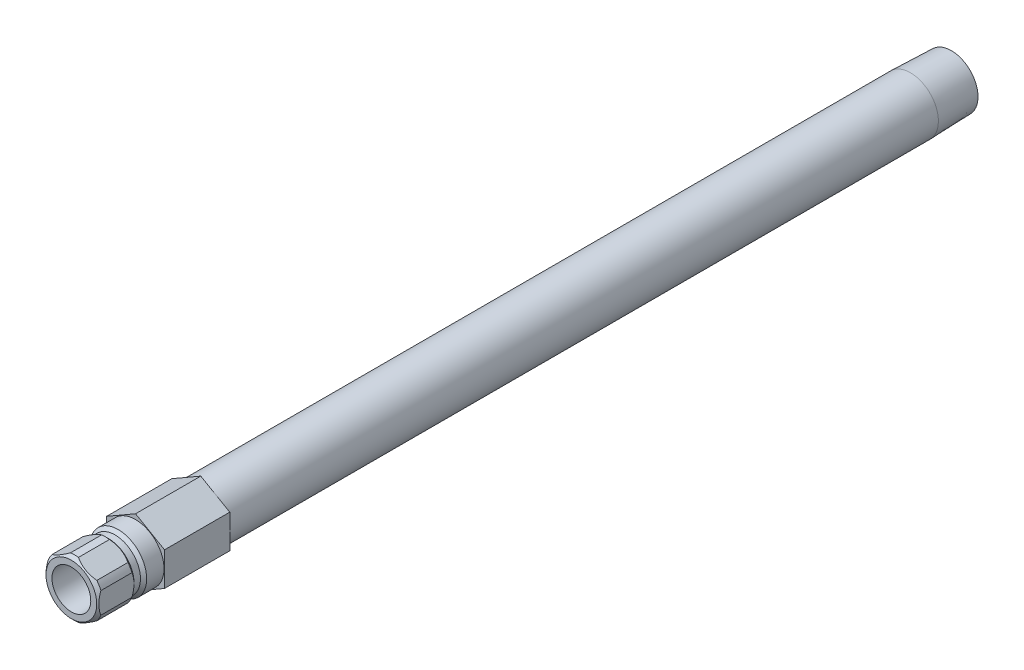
ISO-10303-21;
HEADER;
FILE_DESCRIPTION(('STEP AP214'),'2;1');
FILE_NAME('part.step','',(''),(''),'','','');
FILE_SCHEMA(('AUTOMOTIVE_DESIGN { 1 0 10303 214 1 1 1 1 }'));
ENDSEC;
DATA;
#1=APPLICATION_CONTEXT('core data for automotive mechanical design processes');
#2=APPLICATION_PROTOCOL_DEFINITION('international standard','automotive_design',2000,#1);
#3=PRODUCT_CONTEXT('',#1,'mechanical');
#4=PRODUCT('Part','Part','',(#3));
#5=PRODUCT_RELATED_PRODUCT_CATEGORY('part','',(#4));
#6=PRODUCT_DEFINITION_FORMATION('','',#4);
#7=PRODUCT_DEFINITION_CONTEXT('part definition',#1,'design');
#8=PRODUCT_DEFINITION('design','',#6,#7);
#9=PRODUCT_DEFINITION_SHAPE('','',#8);
#10=(LENGTH_UNIT() NAMED_UNIT(*) SI_UNIT(.MILLI.,.METRE.));
#11=(NAMED_UNIT(*) PLANE_ANGLE_UNIT() SI_UNIT($,.RADIAN.));
#12=(NAMED_UNIT(*) SI_UNIT($,.STERADIAN.) SOLID_ANGLE_UNIT());
#13=UNCERTAINTY_MEASURE_WITH_UNIT(LENGTH_MEASURE(1.E-05),#10,'distance_accuracy_value','');
#14=(GEOMETRIC_REPRESENTATION_CONTEXT(3) GLOBAL_UNCERTAINTY_ASSIGNED_CONTEXT((#13)) GLOBAL_UNIT_ASSIGNED_CONTEXT((#10,
#11,#12)) REPRESENTATION_CONTEXT('',''));
#15=CARTESIAN_POINT('',(0.,0.,0.));
#16=DIRECTION('',(0.,0.,1.));
#17=DIRECTION('',(1.,0.,0.));
#18=AXIS2_PLACEMENT_3D('',#15,#16,#17);
#19=CARTESIAN_POINT('',(0.,0.,12.8748331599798));
#20=DIRECTION('',(0.,0.,-1.));
#21=DIRECTION('',(0.,1.,0.));
#22=AXIS2_PLACEMENT_3D('',#19,#20,#21);
#23=CYLINDRICAL_SURFACE('',#22,6.985);
#24=DIRECTION('',(0.,0.,-1.));
#25=VECTOR('',#24,1.);
#26=CARTESIAN_POINT('',(5.50323442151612,-4.30170151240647,12.8748331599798));
#27=LINE('',#26,#25);
#28=CARTESIAN_POINT('',(5.50323442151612,-4.30170151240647,7.366));
#29=VERTEX_POINT('',#28);
#30=CARTESIAN_POINT('',(5.50323442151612,-4.30170151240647,14.986));
#31=VERTEX_POINT('',#30);
#32=EDGE_CURVE('E452',#29,#31,#27,.F.);
#33=ORIENTED_EDGE('',*,*,#32,.F.);
#34=CARTESIAN_POINT('',(0.,0.,7.366));
#35=DIRECTION('',(0.,0.,-1.));
#36=DIRECTION('',(0.,1.,0.));
#37=AXIS2_PLACEMENT_3D('',#34,#35,#36);
#38=CIRCLE('',#37,6.985);
#39=CARTESIAN_POINT('',(6.477,-2.6150900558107,7.366));
#40=VERTEX_POINT('',#39);
#41=EDGE_CURVE('E190',#40,#29,#38,.T.);
#42=ORIENTED_EDGE('',*,*,#41,.F.);
#43=DIRECTION('',(0.,0.,-1.));
#44=VECTOR('',#43,1.);
#45=CARTESIAN_POINT('',(6.477,-2.6150900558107,12.8748331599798));
#46=LINE('',#45,#44);
#47=CARTESIAN_POINT('',(6.477,-2.6150900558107,14.986));
#48=VERTEX_POINT('',#47);
#49=EDGE_CURVE('E367',#48,#40,#46,.T.);
#50=ORIENTED_EDGE('',*,*,#49,.F.);
#51=CARTESIAN_POINT('',(0.,0.,14.986));
#52=DIRECTION('',(0.,0.,-1.));
#53=DIRECTION('',(0.,1.,0.));
#54=AXIS2_PLACEMENT_3D('',#51,#52,#53);
#55=CIRCLE('',#54,6.985);
#56=EDGE_CURVE('E355',#48,#31,#55,.T.);
#57=ORIENTED_EDGE('',*,*,#56,.T.);
#58=EDGE_LOOP('',(#33,#42,#50,#57));
#59=FACE_BOUND('',#58,.T.);
#60=ADVANCED_FACE('F34',(#59),#23,.T.);
#61=DIRECTION('',(0.,0.,-1.));
#62=VECTOR('',#61,1.);
#63=CARTESIAN_POINT('',(6.477,2.6150900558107,12.8748331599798));
#64=LINE('',#63,#62);
#65=CARTESIAN_POINT('',(6.477,2.6150900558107,7.366));
#66=VERTEX_POINT('',#65);
#67=CARTESIAN_POINT('',(6.477,2.6150900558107,14.986));
#68=VERTEX_POINT('',#67);
#69=EDGE_CURVE('E279',#66,#68,#64,.F.);
#70=ORIENTED_EDGE('',*,*,#69,.F.);
#71=CARTESIAN_POINT('',(5.50323442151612,4.30170151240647,7.366));
#72=VERTEX_POINT('',#71);
#73=EDGE_CURVE('E193',#72,#66,#38,.T.);
#74=ORIENTED_EDGE('',*,*,#73,.F.);
#75=DIRECTION('',(0.,0.,-1.));
#76=VECTOR('',#75,1.);
#77=CARTESIAN_POINT('',(5.50323442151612,4.30170151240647,12.8748331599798));
#78=LINE('',#77,#76);
#79=CARTESIAN_POINT('',(5.50323442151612,4.30170151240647,14.986));
#80=VERTEX_POINT('',#79);
#81=EDGE_CURVE('E351',#80,#72,#78,.T.);
#82=ORIENTED_EDGE('',*,*,#81,.F.);
#83=EDGE_CURVE('E205',#80,#68,#55,.T.);
#84=ORIENTED_EDGE('',*,*,#83,.T.);
#85=EDGE_LOOP('',(#70,#74,#82,#84));
#86=FACE_BOUND('',#85,.T.);
#87=ADVANCED_FACE('F313',(#86),#23,.T.);
#88=DIRECTION('',(0.,0.,-1.));
#89=VECTOR('',#88,1.);
#90=CARTESIAN_POINT('',(0.973765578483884,6.91679156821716,12.8748331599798));
#91=LINE('',#90,#89);
#92=CARTESIAN_POINT('',(0.973765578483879,6.91679156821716,7.366));
#93=VERTEX_POINT('',#92);
#94=CARTESIAN_POINT('',(0.973765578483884,6.91679156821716,14.986));
#95=VERTEX_POINT('',#94);
#96=EDGE_CURVE('E370',#93,#95,#91,.F.);
#97=ORIENTED_EDGE('',*,*,#96,.F.);
#98=CARTESIAN_POINT('',(-0.97376557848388,6.91679156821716,7.366));
#99=VERTEX_POINT('',#98);
#100=EDGE_CURVE('E195',#99,#93,#38,.T.);
#101=ORIENTED_EDGE('',*,*,#100,.F.);
#102=DIRECTION('',(0.,0.,-1.));
#103=VECTOR('',#102,1.);
#104=CARTESIAN_POINT('',(-0.973765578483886,6.91679156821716,12.8748331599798));
#105=LINE('',#104,#103);
#106=CARTESIAN_POINT('',(-0.973765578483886,6.91679156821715,14.986));
#107=VERTEX_POINT('',#106);
#108=EDGE_CURVE('E54',#107,#99,#105,.T.);
#109=ORIENTED_EDGE('',*,*,#108,.F.);
#110=EDGE_CURVE('E201',#107,#95,#55,.T.);
#111=ORIENTED_EDGE('',*,*,#110,.T.);
#112=EDGE_LOOP('',(#97,#101,#109,#111));
#113=FACE_BOUND('',#112,.T.);
#114=ADVANCED_FACE('F318',(#113),#23,.T.);
#115=DIRECTION('',(0.,0.,-1.));
#116=VECTOR('',#115,1.);
#117=CARTESIAN_POINT('',(-5.50323442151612,4.30170151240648,12.8748331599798));
#118=LINE('',#117,#116);
#119=CARTESIAN_POINT('',(-5.50323442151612,4.30170151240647,7.366));
#120=VERTEX_POINT('',#119);
#121=CARTESIAN_POINT('',(-5.50323442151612,4.30170151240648,14.986));
#122=VERTEX_POINT('',#121);
#123=EDGE_CURVE('E349',#120,#122,#118,.F.);
#124=ORIENTED_EDGE('',*,*,#123,.F.);
#125=CARTESIAN_POINT('',(-6.477,2.61509005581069,7.366));
#126=VERTEX_POINT('',#125);
#127=EDGE_CURVE('E194',#126,#120,#38,.T.);
#128=ORIENTED_EDGE('',*,*,#127,.F.);
#129=DIRECTION('',(0.,0.,-1.));
#130=VECTOR('',#129,1.);
#131=CARTESIAN_POINT('',(-6.477,2.61509005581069,12.8748331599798));
#132=LINE('',#131,#130);
#133=CARTESIAN_POINT('',(-6.477,2.61509005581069,14.986));
#134=VERTEX_POINT('',#133);
#135=EDGE_CURVE('E62',#134,#126,#132,.T.);
#136=ORIENTED_EDGE('',*,*,#135,.F.);
#137=EDGE_CURVE('E204',#134,#122,#55,.T.);
#138=ORIENTED_EDGE('',*,*,#137,.T.);
#139=EDGE_LOOP('',(#124,#128,#136,#138));
#140=FACE_BOUND('',#139,.T.);
#141=ADVANCED_FACE('F329',(#140),#23,.T.);
#142=DIRECTION('',(0.,0.,-1.));
#143=VECTOR('',#142,1.);
#144=CARTESIAN_POINT('',(-6.477,-2.61509005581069,12.8748331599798));
#145=LINE('',#144,#143);
#146=CARTESIAN_POINT('',(-6.477,-2.61509005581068,7.366));
#147=VERTEX_POINT('',#146);
#148=CARTESIAN_POINT('',(-6.477,-2.61509005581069,14.986));
#149=VERTEX_POINT('',#148);
#150=EDGE_CURVE('E340',#147,#149,#145,.F.);
#151=ORIENTED_EDGE('',*,*,#150,.F.);
#152=CARTESIAN_POINT('',(-5.50323442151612,-4.30170151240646,7.366));
#153=VERTEX_POINT('',#152);
#154=EDGE_CURVE('E191',#153,#147,#38,.T.);
#155=ORIENTED_EDGE('',*,*,#154,.F.);
#156=DIRECTION('',(0.,0.,-1.));
#157=VECTOR('',#156,1.);
#158=CARTESIAN_POINT('',(-5.50323442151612,-4.30170151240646,12.8748331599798));
#159=LINE('',#158,#157);
#160=CARTESIAN_POINT('',(-5.50323442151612,-4.30170151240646,14.986));
#161=VERTEX_POINT('',#160);
#162=EDGE_CURVE('E168',#161,#153,#159,.T.);
#163=ORIENTED_EDGE('',*,*,#162,.F.);
#164=EDGE_CURVE('E342',#161,#149,#55,.T.);
#165=ORIENTED_EDGE('',*,*,#164,.T.);
#166=EDGE_LOOP('',(#151,#155,#163,#165));
#167=FACE_BOUND('',#166,.T.);
#168=ADVANCED_FACE('F322',(#167),#23,.T.);
#169=CARTESIAN_POINT('',(0.,0.,12.8748331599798));
#170=DIRECTION('',(0.,0.,-1.));
#171=DIRECTION('',(0.,1.,0.));
#172=AXIS2_PLACEMENT_3D('',#169,#170,#171);
#173=CYLINDRICAL_SURFACE('',#172,6.85799999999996);
#174=CARTESIAN_POINT('',(0.,0.,-190.119));
#175=DIRECTION('',(0.,0.,-1.));
#176=DIRECTION('',(0.,1.,0.));
#177=AXIS2_PLACEMENT_3D('',#174,#175,#176);
#178=CIRCLE('',#177,6.85799999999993);
#179=CARTESIAN_POINT('',(0.,6.858,-190.119));
#180=VERTEX_POINT('',#179);
#181=EDGE_CURVE('E520',#180,#180,#178,.T.);
#182=ORIENTED_EDGE('',*,*,#181,.F.);
#183=EDGE_LOOP('',(#182));
#184=FACE_BOUND('',#183,.T.);
#185=CARTESIAN_POINT('',(0.,0.,-16.002));
#186=DIRECTION('',(0.,0.,1.));
#187=DIRECTION('',(1.,0.,0.));
#188=AXIS2_PLACEMENT_3D('',#185,#186,#187);
#189=CIRCLE('',#188,6.85799999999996);
#190=CARTESIAN_POINT('',(6.85799999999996,0.,-16.002));
#191=VERTEX_POINT('',#190);
#192=EDGE_CURVE('E496',#191,#191,#189,.F.);
#193=ORIENTED_EDGE('',*,*,#192,.T.);
#194=EDGE_LOOP('',(#193));
#195=FACE_BOUND('',#194,.T.);
#196=ADVANCED_FACE('F328',(#184,#195),#173,.T.);
#197=CARTESIAN_POINT('',(0.,0.,12.8748331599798));
#198=DIRECTION('',(0.,0.,-1.));
#199=DIRECTION('',(0.,1.,0.));
#200=AXIS2_PLACEMENT_3D('',#197,#198,#199);
#201=CYLINDRICAL_SURFACE('',#200,4.7625);
#202=CARTESIAN_POINT('',(0.,0.,3.556));
#203=DIRECTION('',(0.,0.,-1.));
#204=DIRECTION('',(0.,1.,0.));
#205=AXIS2_PLACEMENT_3D('',#202,#203,#204);
#206=CIRCLE('',#205,4.76249999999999);
#207=CARTESIAN_POINT('',(0.,4.7625,3.556));
#208=VERTEX_POINT('',#207);
#209=EDGE_CURVE('E508',#208,#208,#206,.T.);
#210=ORIENTED_EDGE('',*,*,#209,.T.);
#211=EDGE_LOOP('',(#210));
#212=FACE_BOUND('',#211,.T.);
#213=CARTESIAN_POINT('',(0.,0.,15.748));
#214=DIRECTION('',(0.,0.,-1.));
#215=DIRECTION('',(0.,1.,0.));
#216=AXIS2_PLACEMENT_3D('',#213,#214,#215);
#217=CIRCLE('',#216,4.7625);
#218=CARTESIAN_POINT('',(0.,4.7625,15.748));
#219=VERTEX_POINT('',#218);
#220=EDGE_CURVE('E174',#219,#219,#217,.T.);
#221=ORIENTED_EDGE('',*,*,#220,.F.);
#222=EDGE_LOOP('',(#221));
#223=FACE_BOUND('',#222,.T.);
#224=ADVANCED_FACE('F36',(#212,#223),#201,.F.);
#225=CARTESIAN_POINT('',(0.,4.7625,15.748));
#226=DIRECTION('',(0.,0.,1.));
#227=DIRECTION('',(0.,-1.,0.));
#228=AXIS2_PLACEMENT_3D('',#225,#226,#227);
#229=PLANE('',#228);
#230=ORIENTED_EDGE('',*,*,#220,.T.);
#231=EDGE_LOOP('',(#230));
#232=FACE_BOUND('',#231,.T.);
#233=CARTESIAN_POINT('',(0.,0.,15.748));
#234=DIRECTION('',(0.,0.,-1.));
#235=DIRECTION('',(0.,1.,0.));
#236=AXIS2_PLACEMENT_3D('',#233,#234,#235);
#237=CIRCLE('',#236,6.223);
#238=CARTESIAN_POINT('',(0.,6.223,15.748));
#239=VERTEX_POINT('',#238);
#240=EDGE_CURVE('E206',#239,#239,#237,.T.);
#241=ORIENTED_EDGE('',*,*,#240,.F.);
#242=EDGE_LOOP('',(#241));
#243=FACE_BOUND('',#242,.T.);
#244=ADVANCED_FACE('F241',(#232,#243),#229,.T.);
#245=CARTESIAN_POINT('',(0.,0.,14.986));
#246=DIRECTION('',(0.,0.,-1.));
#247=DIRECTION('',(0.,1.,0.));
#248=AXIS2_PLACEMENT_3D('',#245,#246,#247);
#249=CONICAL_SURFACE('',#248,6.985,0.785398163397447);
#250=CARTESIAN_POINT('',(5.50369701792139,-4.30143443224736,14.9858));
#251=CARTESIAN_POINT('',(5.32269478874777,-4.40593611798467,15.0641166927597));
#252=CARTESIAN_POINT('',(5.13917907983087,-4.51188896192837,15.1353544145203));
#253=CARTESIAN_POINT('',(4.76736839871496,-4.72655395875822,15.2608524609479));
#254=CARTESIAN_POINT('',(4.57906245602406,-4.83527244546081,15.3150691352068));
#255=CARTESIAN_POINT('',(4.20553846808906,-5.05092662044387,15.401724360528));
#256=CARTESIAN_POINT('',(4.02044501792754,-5.15779037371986,15.4348622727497));
#257=CARTESIAN_POINT('',(3.64855359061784,-5.37250198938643,15.4802195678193));
#258=CARTESIAN_POINT('',(3.46175806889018,-5.48034843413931,15.4924653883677));
#259=CARTESIAN_POINT('',(3.08219421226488,-5.69948972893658,15.4953056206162));
#260=CARTESIAN_POINT('',(2.88942157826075,-5.81078706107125,15.4852117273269));
#261=CARTESIAN_POINT('',(2.50551871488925,-6.03243348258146,15.4426708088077));
#262=CARTESIAN_POINT('',(2.31439108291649,-6.14278107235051,15.4101933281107));
#263=CARTESIAN_POINT('',(1.92845877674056,-6.36559919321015,15.3234273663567));
#264=CARTESIAN_POINT('',(1.73378601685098,-6.47799356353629,15.268364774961));
#265=CARTESIAN_POINT('',(1.44558978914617,-6.6443837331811,15.1720079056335));
#266=CARTESIAN_POINT('',(1.35026676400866,-6.69941850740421,15.1376422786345));
#267=CARTESIAN_POINT('',(1.16086120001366,-6.80877186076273,15.0647445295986));
#268=CARTESIAN_POINT('',(1.06677820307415,-6.86309070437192,15.0262139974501));
#269=CARTESIAN_POINT('',(0.973302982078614,-6.91705864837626,14.9858));
#270=B_SPLINE_CURVE_WITH_KNOTS('',3,(#250,#251,#252,#253,#254,#255,#256,#257,#258,#259,#260,
#261,#262,#263,#264,#265,#266,#267,#268,#269),.UNSPECIFIED.,.F.,.F.,(4,2,2,2,2,2,2,2,2,4),(0.,
0.669810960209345,1.34132587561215,1.9892054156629,2.63626449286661,3.30353665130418,
3.97171850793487,4.66502165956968,5.01088265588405,5.35661208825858),.UNSPECIFIED.);
#271=CARTESIAN_POINT('',(0.973765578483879,-6.91679156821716,14.986));
#272=VERTEX_POINT('',#271);
#273=EDGE_CURVE('E451',#31,#272,#270,.T.);
#274=ORIENTED_EDGE('',*,*,#273,.F.);
#275=ORIENTED_EDGE('',*,*,#56,.F.);
#276=CARTESIAN_POINT('',(6.477,-7.50531717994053,12.0573066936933));
#277=CARTESIAN_POINT('',(6.477,-7.32278230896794,12.1954662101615));
#278=CARTESIAN_POINT('',(6.477,-7.13923073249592,12.3323042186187));
#279=CARTESIAN_POINT('',(6.477,-6.76969107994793,12.6027438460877));
#280=CARTESIAN_POINT('',(6.477,-6.58370240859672,12.7363446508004));
#281=CARTESIAN_POINT('',(6.477,-6.20752484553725,13.0006667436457));
#282=CARTESIAN_POINT('',(6.477,-6.01731457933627,13.1313577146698));
#283=CARTESIAN_POINT('',(6.477,-5.63367369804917,13.3879087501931));
#284=CARTESIAN_POINT('',(6.477,-5.44024331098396,13.5137691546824));
#285=CARTESIAN_POINT('',(6.477,-5.03831720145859,13.7667102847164));
#286=CARTESIAN_POINT('',(6.477,-4.8295984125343,13.893438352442));
#287=CARTESIAN_POINT('',(6.477,-4.4072839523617,14.1386241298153));
#288=CARTESIAN_POINT('',(6.477,-4.19368750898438,14.2570805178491));
#289=CARTESIAN_POINT('',(6.477,-3.7616267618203,14.4831715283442));
#290=CARTESIAN_POINT('',(6.477,-3.54317924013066,14.5908379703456));
#291=CARTESIAN_POINT('',(6.477,-3.100295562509,14.7929384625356));
#292=CARTESIAN_POINT('',(6.477,-2.87586219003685,14.8873785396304));
#293=CARTESIAN_POINT('',(6.477,-2.43955826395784,15.0524966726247));
#294=CARTESIAN_POINT('',(6.477,-2.22819339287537,15.1244971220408));
#295=CARTESIAN_POINT('',(6.477,-1.80033354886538,15.2515475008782));
#296=CARTESIAN_POINT('',(6.477,-1.58383822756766,15.3065962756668));
#297=CARTESIAN_POINT('',(6.477,-1.15063390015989,15.3959385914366));
#298=CARTESIAN_POINT('',(6.477,-0.934000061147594,15.4305906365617));
#299=CARTESIAN_POINT('',(6.477,-0.498364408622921,15.4784594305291));
#300=CARTESIAN_POINT('',(6.477,-0.279363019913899,15.4916799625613));
#301=CARTESIAN_POINT('',(6.477,0.150697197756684,15.4956835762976));
#302=CARTESIAN_POINT('',(6.477,0.361748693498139,15.4872823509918));
#303=CARTESIAN_POINT('',(6.477,0.782066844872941,15.4503172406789));
#304=CARTESIAN_POINT('',(6.477,0.991333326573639,15.421751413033));
#305=CARTESIAN_POINT('',(6.477,1.41010575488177,15.3455375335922));
#306=CARTESIAN_POINT('',(6.477,1.6195513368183,15.2975631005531));
#307=CARTESIAN_POINT('',(6.477,2.03387291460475,15.1851046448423));
#308=CARTESIAN_POINT('',(6.477,2.2387492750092,15.1206219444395));
#309=CARTESIAN_POINT('',(6.477,2.66141718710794,14.9715598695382));
#310=CARTESIAN_POINT('',(6.477,2.87875617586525,14.8857103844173));
#311=CARTESIAN_POINT('',(6.477,3.30779766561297,14.7008180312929));
#312=CARTESIAN_POINT('',(6.477,3.51949749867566,14.6017690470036));
#313=CARTESIAN_POINT('',(6.477,3.9382898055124,14.3928329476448));
#314=CARTESIAN_POINT('',(6.477,4.14536521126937,14.282911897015));
#315=CARTESIAN_POINT('',(6.477,4.55475391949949,14.0546596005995));
#316=CARTESIAN_POINT('',(6.477,4.75706796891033,13.93632968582));
#317=CARTESIAN_POINT('',(6.477,5.14761370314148,13.6989609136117));
#318=CARTESIAN_POINT('',(6.477,5.33604552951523,13.580249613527));
#319=CARTESIAN_POINT('',(6.477,5.70967381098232,13.3378251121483));
#320=CARTESIAN_POINT('',(6.477,5.89487001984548,13.2141115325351));
#321=CARTESIAN_POINT('',(6.477,6.26095063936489,12.9635958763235));
#322=CARTESIAN_POINT('',(6.477,6.44185783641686,12.8368269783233));
#323=CARTESIAN_POINT('',(6.477,6.80119835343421,12.5799293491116));
#324=CARTESIAN_POINT('',(6.477,6.97963234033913,12.4498015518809));
#325=CARTESIAN_POINT('',(6.477,7.15703038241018,12.3183002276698));
#326=B_SPLINE_CURVE_WITH_KNOTS('',3,(#276,#277,#278,#279,#280,#281,#282,#283,#284,#285,#286,
#287,#288,#289,#290,#291,#292,#293,#294,#295,#296,#297,#298,#299,#300,#301,#302,#303,#304,#305,
#306,#307,#308,#309,#310,#311,#312,#313,#314,#315,#316,#317,#318,#319,#320,#321,#322,#323,#324,
#325),.UNSPECIFIED.,.F.,.F.,(4,2,2,2,2,2,2,2,2,2,2,2,2,2,2,2,2,2,2,2,2,2,2,2,4),(0.,
0.686790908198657,1.37375281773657,2.06603541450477,2.75826919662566,3.49065471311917,
4.22315698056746,4.95343127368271,5.68337170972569,6.35265989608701,7.02199365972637,
7.67918147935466,8.33625327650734,8.96890298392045,9.6016136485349,10.2454384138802,
10.8892116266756,11.5897073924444,12.2905288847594,12.9936114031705,13.6965828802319,
14.3646145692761,15.0326968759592,15.6953618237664,16.3578444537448),.UNSPECIFIED.);
#327=EDGE_CURVE('E271',#68,#48,#326,.F.);
#328=ORIENTED_EDGE('',*,*,#327,.F.);
#329=ORIENTED_EDGE('',*,*,#83,.F.);
#330=CARTESIAN_POINT('',(0.973302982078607,6.91705864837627,14.9858));
#331=CARTESIAN_POINT('',(1.15430521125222,6.81255696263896,15.0641166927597));
#332=CARTESIAN_POINT('',(1.33782092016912,6.70660411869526,15.1353544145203));
#333=CARTESIAN_POINT('',(1.70963160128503,6.49193912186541,15.2608524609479));
#334=CARTESIAN_POINT('',(1.89793754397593,6.38322063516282,15.3150691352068));
#335=CARTESIAN_POINT('',(2.27146153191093,6.16756646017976,15.401724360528));
#336=CARTESIAN_POINT('',(2.45655498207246,6.06070270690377,15.4348622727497));
#337=CARTESIAN_POINT('',(2.82844640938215,5.8459910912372,15.4802195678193));
#338=CARTESIAN_POINT('',(3.01524193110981,5.73814464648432,15.4924653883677));
#339=CARTESIAN_POINT('',(3.39480578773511,5.51900335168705,15.4953056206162));
#340=CARTESIAN_POINT('',(3.58757842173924,5.40770601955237,15.4852117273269));
#341=CARTESIAN_POINT('',(3.97148128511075,5.18605959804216,15.4426708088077));
#342=CARTESIAN_POINT('',(4.16260891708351,5.07571200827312,15.4101933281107));
#343=CARTESIAN_POINT('',(4.54854122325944,4.85289388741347,15.3234273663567));
#344=CARTESIAN_POINT('',(4.74321398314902,4.74049951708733,15.268364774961));
#345=CARTESIAN_POINT('',(5.03141021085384,4.57410934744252,15.1720079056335));
#346=CARTESIAN_POINT('',(5.12673323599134,4.51907457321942,15.1376422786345));
#347=CARTESIAN_POINT('',(5.31613879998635,4.40972121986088,15.0647445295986));
#348=CARTESIAN_POINT('',(5.41022179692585,4.3554023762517,15.0262139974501));
#349=CARTESIAN_POINT('',(5.50369701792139,4.30143443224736,14.9858));
#350=B_SPLINE_CURVE_WITH_KNOTS('',3,(#330,#331,#332,#333,#334,#335,#336,#337,#338,#339,#340,
#341,#342,#343,#344,#345,#346,#347,#348,#349),.UNSPECIFIED.,.F.,.F.,(4,2,2,2,2,2,2,2,2,4),(0.,
0.669810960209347,1.34132587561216,1.9892054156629,2.63626449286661,3.30353665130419,
3.97171850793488,4.66502165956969,5.01088265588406,5.35661208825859),.UNSPECIFIED.);
#351=EDGE_CURVE('E263',#95,#80,#350,.T.);
#352=ORIENTED_EDGE('',*,*,#351,.F.);
#353=ORIENTED_EDGE('',*,*,#110,.F.);
#354=CARTESIAN_POINT('',(-5.50369701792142,4.30143443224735,14.9858));
#355=CARTESIAN_POINT('',(-5.3226947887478,4.40593611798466,15.0641166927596));
#356=CARTESIAN_POINT('',(-5.1391790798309,4.51188896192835,15.1353544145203));
#357=CARTESIAN_POINT('',(-4.76736839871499,4.72655395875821,15.2608524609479));
#358=CARTESIAN_POINT('',(-4.57906245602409,4.8352724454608,15.3150691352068));
#359=CARTESIAN_POINT('',(-4.20553846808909,5.05092662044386,15.401724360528));
#360=CARTESIAN_POINT('',(-4.02044501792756,5.15779037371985,15.4348622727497));
#361=CARTESIAN_POINT('',(-3.64855359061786,5.37250198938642,15.4802195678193));
#362=CARTESIAN_POINT('',(-3.4617580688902,5.4803484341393,15.4924653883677));
#363=CARTESIAN_POINT('',(-3.0821942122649,5.69948972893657,15.4953056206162));
#364=CARTESIAN_POINT('',(-2.88942157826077,5.81078706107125,15.4852117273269));
#365=CARTESIAN_POINT('',(-2.50551871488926,6.03243348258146,15.4426708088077));
#366=CARTESIAN_POINT('',(-2.3143910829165,6.14278107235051,15.4101933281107));
#367=CARTESIAN_POINT('',(-1.92845877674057,6.36559919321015,15.3234273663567));
#368=CARTESIAN_POINT('',(-1.73378601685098,6.47799356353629,15.268364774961));
#369=CARTESIAN_POINT('',(-1.44558978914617,6.6443837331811,15.1720079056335));
#370=CARTESIAN_POINT('',(-1.35026676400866,6.69941850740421,15.1376422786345));
#371=CARTESIAN_POINT('',(-1.16086120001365,6.80877186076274,15.0647445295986));
#372=CARTESIAN_POINT('',(-1.06677820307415,6.86309070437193,15.0262139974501));
#373=CARTESIAN_POINT('',(-0.97330298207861,6.91705864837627,14.9858));
#374=B_SPLINE_CURVE_WITH_KNOTS('',3,(#354,#355,#356,#357,#358,#359,#360,#361,#362,#363,#364,
#365,#366,#367,#368,#369,#370,#371,#372,#373),.UNSPECIFIED.,.F.,.F.,(4,2,2,2,2,2,2,2,2,4),(0.,
0.66981096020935,1.34132587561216,1.98920541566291,2.63626449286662,3.3035366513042,
3.9717185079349,4.66502165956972,5.01088265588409,5.35661208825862),.UNSPECIFIED.);
#375=EDGE_CURVE('E256',#122,#107,#374,.T.);
#376=ORIENTED_EDGE('',*,*,#375,.F.);
#377=ORIENTED_EDGE('',*,*,#137,.F.);
#378=CARTESIAN_POINT('',(-6.477,-7.50531717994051,12.0573066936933));
#379=CARTESIAN_POINT('',(-6.477,-7.32278230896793,12.1954662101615));
#380=CARTESIAN_POINT('',(-6.477,-7.13923073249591,12.3323042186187));
#381=CARTESIAN_POINT('',(-6.477,-6.76969107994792,12.6027438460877));
#382=CARTESIAN_POINT('',(-6.477,-6.58370240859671,12.7363446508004));
#383=CARTESIAN_POINT('',(-6.477,-6.20752484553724,13.0006667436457));
#384=CARTESIAN_POINT('',(-6.477,-6.01731457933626,13.1313577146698));
#385=CARTESIAN_POINT('',(-6.477,-5.63367369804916,13.3879087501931));
#386=CARTESIAN_POINT('',(-6.477,-5.44024331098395,13.5137691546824));
#387=CARTESIAN_POINT('',(-6.477,-5.03831720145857,13.7667102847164));
#388=CARTESIAN_POINT('',(-6.477,-4.82959841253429,13.8934383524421));
#389=CARTESIAN_POINT('',(-6.477,-4.40728395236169,14.1386241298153));
#390=CARTESIAN_POINT('',(-6.477,-4.19368750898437,14.2570805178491));
#391=CARTESIAN_POINT('',(-6.477,-3.76162676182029,14.4831715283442));
#392=CARTESIAN_POINT('',(-6.477,-3.54317924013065,14.5908379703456));
#393=CARTESIAN_POINT('',(-6.477,-3.10029556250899,14.7929384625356));
#394=CARTESIAN_POINT('',(-6.477,-2.87586219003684,14.8873785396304));
#395=CARTESIAN_POINT('',(-6.477,-2.43955826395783,15.0524966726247));
#396=CARTESIAN_POINT('',(-6.477,-2.22819339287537,15.1244971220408));
#397=CARTESIAN_POINT('',(-6.477,-1.80033354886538,15.2515475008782));
#398=CARTESIAN_POINT('',(-6.477,-1.58383822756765,15.3065962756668));
#399=CARTESIAN_POINT('',(-6.477,-1.15063390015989,15.3959385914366));
#400=CARTESIAN_POINT('',(-6.477,-0.934000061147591,15.4305906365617));
#401=CARTESIAN_POINT('',(-6.477,-0.49836440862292,15.4784594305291));
#402=CARTESIAN_POINT('',(-6.477,-0.279363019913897,15.4916799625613));
#403=CARTESIAN_POINT('',(-6.477,0.150697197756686,15.4956835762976));
#404=CARTESIAN_POINT('',(-6.477,0.361748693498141,15.4872823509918));
#405=CARTESIAN_POINT('',(-6.477,0.782066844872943,15.4503172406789));
#406=CARTESIAN_POINT('',(-6.477,0.991333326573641,15.421751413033));
#407=CARTESIAN_POINT('',(-6.477,1.41010575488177,15.3455375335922));
#408=CARTESIAN_POINT('',(-6.477,1.6195513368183,15.2975631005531));
#409=CARTESIAN_POINT('',(-6.477,2.03387291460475,15.1851046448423));
#410=CARTESIAN_POINT('',(-6.477,2.2387492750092,15.1206219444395));
#411=CARTESIAN_POINT('',(-6.477,2.66141718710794,14.9715598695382));
#412=CARTESIAN_POINT('',(-6.477,2.87875617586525,14.8857103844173));
#413=CARTESIAN_POINT('',(-6.477,3.30779766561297,14.7008180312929));
#414=CARTESIAN_POINT('',(-6.477,3.51949749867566,14.6017690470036));
#415=CARTESIAN_POINT('',(-6.477,3.93828980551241,14.3928329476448));
#416=CARTESIAN_POINT('',(-6.477,4.14536521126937,14.282911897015));
#417=CARTESIAN_POINT('',(-6.477,4.55475391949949,14.0546596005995));
#418=CARTESIAN_POINT('',(-6.477,4.75706796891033,13.93632968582));
#419=CARTESIAN_POINT('',(-6.477,5.14761370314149,13.6989609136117));
#420=CARTESIAN_POINT('',(-6.477,5.33604552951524,13.580249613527));
#421=CARTESIAN_POINT('',(-6.477,5.70967381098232,13.3378251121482));
#422=CARTESIAN_POINT('',(-6.477,5.89487001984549,13.2141115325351));
#423=CARTESIAN_POINT('',(-6.477,6.2609506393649,12.9635958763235));
#424=CARTESIAN_POINT('',(-6.477,6.44185783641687,12.8368269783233));
#425=CARTESIAN_POINT('',(-6.477,6.80119835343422,12.5799293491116));
#426=CARTESIAN_POINT('',(-6.477,6.97963234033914,12.4498015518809));
#427=CARTESIAN_POINT('',(-6.477,7.15703038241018,12.3183002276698));
#428=B_SPLINE_CURVE_WITH_KNOTS('',3,(#378,#379,#380,#381,#382,#383,#384,#385,#386,#387,#388,
#389,#390,#391,#392,#393,#394,#395,#396,#397,#398,#399,#400,#401,#402,#403,#404,#405,#406,#407,
#408,#409,#410,#411,#412,#413,#414,#415,#416,#417,#418,#419,#420,#421,#422,#423,#424,#425,#426,
#427),.UNSPECIFIED.,.F.,.F.,(4,2,2,2,2,2,2,2,2,2,2,2,2,2,2,2,2,2,2,2,2,2,2,2,4),(0.,
0.686790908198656,1.37375281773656,2.06603541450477,2.75826919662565,3.49065471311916,
4.22315698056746,4.9534312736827,5.68337170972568,6.352659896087,7.02199365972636,
7.67918147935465,8.33625327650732,8.96890298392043,9.60161364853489,10.2454384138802,
10.8892116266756,11.5897073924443,12.2905288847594,12.9936114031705,13.6965828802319,
14.3646145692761,15.0326968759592,15.6953618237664,16.3578444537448),.UNSPECIFIED.);
#429=EDGE_CURVE('E249',#149,#134,#428,.T.);
#430=ORIENTED_EDGE('',*,*,#429,.F.);
#431=ORIENTED_EDGE('',*,*,#164,.F.);
#432=CARTESIAN_POINT('',(-0.973302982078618,-6.91705864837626,14.9858));
#433=CARTESIAN_POINT('',(-1.15430521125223,-6.81255696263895,15.0641166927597));
#434=CARTESIAN_POINT('',(-1.33782092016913,-6.70660411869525,15.1353544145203));
#435=CARTESIAN_POINT('',(-1.70963160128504,-6.49193912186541,15.2608524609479));
#436=CARTESIAN_POINT('',(-1.89793754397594,-6.38322063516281,15.3150691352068));
#437=CARTESIAN_POINT('',(-2.27146153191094,-6.16756646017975,15.401724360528));
#438=CARTESIAN_POINT('',(-2.45655498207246,-6.06070270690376,15.4348622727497));
#439=CARTESIAN_POINT('',(-2.82844640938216,-5.84599109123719,15.4802195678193));
#440=CARTESIAN_POINT('',(-3.01524193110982,-5.73814464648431,15.4924653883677));
#441=CARTESIAN_POINT('',(-3.39480578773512,-5.51900335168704,15.4953056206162));
#442=CARTESIAN_POINT('',(-3.58757842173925,-5.40770601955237,15.4852117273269));
#443=CARTESIAN_POINT('',(-3.97148128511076,-5.18605959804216,15.4426708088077));
#444=CARTESIAN_POINT('',(-4.16260891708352,-5.07571200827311,15.4101933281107));
#445=CARTESIAN_POINT('',(-4.54854122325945,-4.85289388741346,15.3234273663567));
#446=CARTESIAN_POINT('',(-4.74321398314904,-4.74049951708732,15.268364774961));
#447=CARTESIAN_POINT('',(-5.03141021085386,-4.57410934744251,15.1720079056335));
#448=CARTESIAN_POINT('',(-5.12673323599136,-4.5190745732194,15.1376422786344));
#449=CARTESIAN_POINT('',(-5.31613879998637,-4.40972121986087,15.0647445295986));
#450=CARTESIAN_POINT('',(-5.41022179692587,-4.35540237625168,15.0262139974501));
#451=CARTESIAN_POINT('',(-5.50369701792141,-4.30143443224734,14.9858));
#452=B_SPLINE_CURVE_WITH_KNOTS('',3,(#432,#433,#434,#435,#436,#437,#438,#439,#440,#441,#442,
#443,#444,#445,#446,#447,#448,#449,#450,#451),.UNSPECIFIED.,.F.,.F.,(4,2,2,2,2,2,2,2,2,4),(0.,
0.669810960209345,1.34132587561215,1.9892054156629,2.6362644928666,3.30353665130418,
3.97171850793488,4.6650216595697,5.01088265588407,5.35661208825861),.UNSPECIFIED.);
#453=CARTESIAN_POINT('',(-0.973765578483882,-6.91679156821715,14.986));
#454=VERTEX_POINT('',#453);
#455=EDGE_CURVE('E184',#454,#161,#452,.T.);
#456=ORIENTED_EDGE('',*,*,#455,.F.);
#457=EDGE_CURVE('E183',#272,#454,#55,.T.);
#458=ORIENTED_EDGE('',*,*,#457,.F.);
#459=EDGE_LOOP('',(#274,#275,#328,#329,#352,#353,#376,#377,#430,#431,#456,#458));
#460=FACE_BOUND('',#459,.T.);
#461=ORIENTED_EDGE('',*,*,#240,.T.);
#462=EDGE_LOOP('',(#461));
#463=FACE_BOUND('',#462,.T.);
#464=ADVANCED_FACE('F238',(#460,#463),#249,.T.);
#465=DIRECTION('',(0.,0.,-1.));
#466=VECTOR('',#465,1.);
#467=CARTESIAN_POINT('',(0.973765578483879,-6.91679156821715,12.8748331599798));
#468=LINE('',#467,#466);
#469=CARTESIAN_POINT('',(0.973765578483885,-6.91679156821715,7.366));
#470=VERTEX_POINT('',#469);
#471=EDGE_CURVE('E278',#272,#470,#468,.T.);
#472=ORIENTED_EDGE('',*,*,#471,.F.);
#473=ORIENTED_EDGE('',*,*,#457,.T.);
#474=DIRECTION('',(0.,0.,-1.));
#475=VECTOR('',#474,1.);
#476=CARTESIAN_POINT('',(-0.973765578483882,-6.91679156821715,12.8748331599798));
#477=LINE('',#476,#475);
#478=CARTESIAN_POINT('',(-0.973765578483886,-6.91679156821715,7.366));
#479=VERTEX_POINT('',#478);
#480=EDGE_CURVE('E165',#479,#454,#477,.F.);
#481=ORIENTED_EDGE('',*,*,#480,.F.);
#482=EDGE_CURVE('E181',#470,#479,#38,.T.);
#483=ORIENTED_EDGE('',*,*,#482,.F.);
#484=EDGE_LOOP('',(#472,#473,#481,#483));
#485=FACE_BOUND('',#484,.T.);
#486=ADVANCED_FACE('F180',(#485),#23,.T.);
#487=CARTESIAN_POINT('',(0.,0.,6.604));
#488=DIRECTION('',(0.,0.,1.));
#489=DIRECTION('',(0.,-1.,0.));
#490=AXIS2_PLACEMENT_3D('',#487,#488,#489);
#491=CONICAL_SURFACE('',#490,6.223,0.785398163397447);
#492=CARTESIAN_POINT('',(0.973302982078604,-6.91705864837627,7.3662));
#493=CARTESIAN_POINT('',(1.15430521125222,-6.81255696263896,7.28788330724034));
#494=CARTESIAN_POINT('',(1.33782092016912,-6.70660411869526,7.21664558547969));
#495=CARTESIAN_POINT('',(1.70963160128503,-6.49193912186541,7.09114753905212));
#496=CARTESIAN_POINT('',(1.89793754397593,-6.38322063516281,7.03693086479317));
#497=CARTESIAN_POINT('',(2.27146153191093,-6.16756646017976,6.95027563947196));
#498=CARTESIAN_POINT('',(2.45655498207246,-6.06070270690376,6.91713772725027));
#499=CARTESIAN_POINT('',(2.82844640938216,-5.8459910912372,6.87178043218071));
#500=CARTESIAN_POINT('',(3.01524193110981,-5.73814464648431,6.85953461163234));
#501=CARTESIAN_POINT('',(3.39480578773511,-5.51900335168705,6.85669437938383));
#502=CARTESIAN_POINT('',(3.58757842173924,-5.40770601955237,6.86678827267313));
#503=CARTESIAN_POINT('',(3.97148128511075,-5.18605959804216,6.9093291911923));
#504=CARTESIAN_POINT('',(4.16260891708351,-5.07571200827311,6.9418066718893));
#505=CARTESIAN_POINT('',(4.54854122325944,-4.85289388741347,7.02857263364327));
#506=CARTESIAN_POINT('',(4.74321398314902,-4.74049951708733,7.08363522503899));
#507=CARTESIAN_POINT('',(5.03141021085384,-4.57410934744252,7.17999209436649));
#508=CARTESIAN_POINT('',(5.12673323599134,-4.51907457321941,7.21435772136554));
#509=CARTESIAN_POINT('',(5.31613879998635,-4.40972121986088,7.28725547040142));
#510=CARTESIAN_POINT('',(5.41022179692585,-4.35540237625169,7.32578600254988));
#511=CARTESIAN_POINT('',(5.50369701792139,-4.30143443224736,7.3662));
#512=B_SPLINE_CURVE_WITH_KNOTS('',3,(#492,#493,#494,#495,#496,#497,#498,#499,#500,#501,#502,
#503,#504,#505,#506,#507,#508,#509,#510,#511),.UNSPECIFIED.,.F.,.F.,(4,2,2,2,2,2,2,2,2,4),(0.,
0.669810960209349,1.34132587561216,1.9892054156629,2.63626449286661,3.30353665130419,
3.97171850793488,4.6650216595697,5.01088265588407,5.3566120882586),.UNSPECIFIED.);
#513=EDGE_CURVE('E12',#470,#29,#512,.T.);
#514=ORIENTED_EDGE('',*,*,#513,.F.);
#515=ORIENTED_EDGE('',*,*,#482,.T.);
#516=CARTESIAN_POINT('',(-5.50369701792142,-4.30143443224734,7.36620000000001));
#517=CARTESIAN_POINT('',(-5.32269478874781,-4.40593611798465,7.28788330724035));
#518=CARTESIAN_POINT('',(-5.13917907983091,-4.51188896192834,7.2166455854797));
#519=CARTESIAN_POINT('',(-4.767368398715,-4.7265539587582,7.09114753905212));
#520=CARTESIAN_POINT('',(-4.57906245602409,-4.83527244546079,7.03693086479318));
#521=CARTESIAN_POINT('',(-4.20553846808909,-5.05092662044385,6.95027563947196));
#522=CARTESIAN_POINT('',(-4.02044501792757,-5.15779037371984,6.91713772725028));
#523=CARTESIAN_POINT('',(-3.64855359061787,-5.37250198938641,6.87178043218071));
#524=CARTESIAN_POINT('',(-3.46175806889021,-5.48034843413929,6.85953461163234));
#525=CARTESIAN_POINT('',(-3.08219421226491,-5.69948972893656,6.85669437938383));
#526=CARTESIAN_POINT('',(-2.88942157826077,-5.81078706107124,6.86678827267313));
#527=CARTESIAN_POINT('',(-2.50551871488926,-6.03243348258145,6.9093291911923));
#528=CARTESIAN_POINT('',(-2.3143910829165,-6.1427810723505,6.9418066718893));
#529=CARTESIAN_POINT('',(-1.92845877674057,-6.36559919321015,7.02857263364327));
#530=CARTESIAN_POINT('',(-1.73378601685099,-6.47799356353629,7.08363522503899));
#531=CARTESIAN_POINT('',(-1.44558978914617,-6.6443837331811,7.17999209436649));
#532=CARTESIAN_POINT('',(-1.35026676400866,-6.69941850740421,7.21435772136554));
#533=CARTESIAN_POINT('',(-1.16086120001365,-6.80877186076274,7.28725547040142));
#534=CARTESIAN_POINT('',(-1.06677820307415,-6.86309070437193,7.32578600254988));
#535=CARTESIAN_POINT('',(-0.97330298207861,-6.91705864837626,7.3662));
#536=B_SPLINE_CURVE_WITH_KNOTS('',3,(#516,#517,#518,#519,#520,#521,#522,#523,#524,#525,#526,
#527,#528,#529,#530,#531,#532,#533,#534,#535),.UNSPECIFIED.,.F.,.F.,(4,2,2,2,2,2,2,2,2,4),(0.,
0.669810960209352,1.34132587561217,1.98920541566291,2.63626449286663,3.30353665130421,
3.9717185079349,4.66502165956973,5.0108826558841,5.35661208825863),.UNSPECIFIED.);
#537=EDGE_CURVE('E162',#153,#479,#536,.T.);
#538=ORIENTED_EDGE('',*,*,#537,.F.);
#539=ORIENTED_EDGE('',*,*,#154,.T.);
#540=CARTESIAN_POINT('',(-6.477,-7.50531717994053,10.2946933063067));
#541=CARTESIAN_POINT('',(-6.477,-7.32278230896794,10.1565337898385));
#542=CARTESIAN_POINT('',(-6.477,-7.13923073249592,10.0196957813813));
#543=CARTESIAN_POINT('',(-6.477,-6.76969107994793,9.74925615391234));
#544=CARTESIAN_POINT('',(-6.477,-6.58370240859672,9.61565534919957));
#545=CARTESIAN_POINT('',(-6.477,-6.20752484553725,9.35133325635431));
#546=CARTESIAN_POINT('',(-6.477,-6.01731457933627,9.22064228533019));
#547=CARTESIAN_POINT('',(-6.477,-5.63367369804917,8.96409124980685));
#548=CARTESIAN_POINT('',(-6.477,-5.44024331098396,8.83823084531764));
#549=CARTESIAN_POINT('',(-6.477,-5.03831720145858,8.58528971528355));
#550=CARTESIAN_POINT('',(-6.477,-4.8295984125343,8.45856164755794));
#551=CARTESIAN_POINT('',(-6.477,-4.4072839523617,8.21337587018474));
#552=CARTESIAN_POINT('',(-6.477,-4.19368750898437,8.09491948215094));
#553=CARTESIAN_POINT('',(-6.477,-3.7616267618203,7.8688284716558));
#554=CARTESIAN_POINT('',(-6.477,-3.54317924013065,7.76116202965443));
#555=CARTESIAN_POINT('',(-6.477,-3.100295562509,7.55906153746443));
#556=CARTESIAN_POINT('',(-6.477,-2.87586219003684,7.46462146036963));
#557=CARTESIAN_POINT('',(-6.477,-2.43955826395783,7.2995033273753));
#558=CARTESIAN_POINT('',(-6.477,-2.22819339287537,7.2275028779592));
#559=CARTESIAN_POINT('',(-6.477,-1.80033354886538,7.1004524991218));
#560=CARTESIAN_POINT('',(-6.477,-1.58383822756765,7.0454037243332));
#561=CARTESIAN_POINT('',(-6.477,-1.15063390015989,6.95606140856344));
#562=CARTESIAN_POINT('',(-6.477,-0.934000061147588,6.9214093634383));
#563=CARTESIAN_POINT('',(-6.477,-0.498364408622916,6.87354056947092));
#564=CARTESIAN_POINT('',(-6.477,-0.279363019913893,6.86032003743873));
#565=CARTESIAN_POINT('',(-6.477,0.15069719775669,6.85631642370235));
#566=CARTESIAN_POINT('',(-6.477,0.361748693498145,6.86471764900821));
#567=CARTESIAN_POINT('',(-6.477,0.782066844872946,6.90168275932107));
#568=CARTESIAN_POINT('',(-6.477,0.991333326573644,6.93024858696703));
#569=CARTESIAN_POINT('',(-6.477,1.41010575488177,7.00646246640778));
#570=CARTESIAN_POINT('',(-6.477,1.61955133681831,7.05443689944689));
#571=CARTESIAN_POINT('',(-6.477,2.03387291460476,7.16689535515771));
#572=CARTESIAN_POINT('',(-6.477,2.23874927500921,7.2313780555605));
#573=CARTESIAN_POINT('',(-6.477,2.66141718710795,7.38044013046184));
#574=CARTESIAN_POINT('',(-6.477,2.87875617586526,7.46628961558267));
#575=CARTESIAN_POINT('',(-6.477,3.30779766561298,7.65118196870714));
#576=CARTESIAN_POINT('',(-6.477,3.51949749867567,7.75023095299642));
#577=CARTESIAN_POINT('',(-6.477,3.93828980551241,7.95916705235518));
#578=CARTESIAN_POINT('',(-6.477,4.14536521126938,8.06908810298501));
#579=CARTESIAN_POINT('',(-6.477,4.5547539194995,8.2973403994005));
#580=CARTESIAN_POINT('',(-6.477,4.75706796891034,8.41567031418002));
#581=CARTESIAN_POINT('',(-6.477,5.1476137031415,8.65303908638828));
#582=CARTESIAN_POINT('',(-6.477,5.33604552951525,8.77175038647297));
#583=CARTESIAN_POINT('',(-6.477,5.70967381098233,9.01417488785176));
#584=CARTESIAN_POINT('',(-6.477,5.8948700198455,9.13788846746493));
#585=CARTESIAN_POINT('',(-6.477,6.26095063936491,9.38840412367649));
#586=CARTESIAN_POINT('',(-6.477,6.44185783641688,9.51517302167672));
#587=CARTESIAN_POINT('',(-6.477,6.80119835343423,9.7720706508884));
#588=CARTESIAN_POINT('',(-6.477,6.97963234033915,9.90219844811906));
#589=CARTESIAN_POINT('',(-6.477,7.1570303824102,10.0336997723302));
#590=B_SPLINE_CURVE_WITH_KNOTS('',3,(#540,#541,#542,#543,#544,#545,#546,#547,#548,#549,#550,
#551,#552,#553,#554,#555,#556,#557,#558,#559,#560,#561,#562,#563,#564,#565,#566,#567,#568,#569,
#570,#571,#572,#573,#574,#575,#576,#577,#578,#579,#580,#581,#582,#583,#584,#585,#586,#587,#588,
#589),.UNSPECIFIED.,.F.,.F.,(4,2,2,2,2,2,2,2,2,2,2,2,2,2,2,2,2,2,2,2,2,2,2,2,4),(0.,
0.68679090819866,1.37375281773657,2.06603541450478,2.75826919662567,3.49065471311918,
4.22315698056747,4.95343127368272,5.68337170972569,6.35265989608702,7.02199365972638,
7.67918147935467,8.33625327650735,8.96890298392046,9.60161364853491,10.2454384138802,
10.8892116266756,11.5897073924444,12.2905288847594,12.9936114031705,13.6965828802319,
14.3646145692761,15.0326968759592,15.6953618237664,16.3578444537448),.UNSPECIFIED.);
#591=EDGE_CURVE('E173',#126,#147,#590,.F.);
#592=ORIENTED_EDGE('',*,*,#591,.F.);
#593=ORIENTED_EDGE('',*,*,#127,.T.);
#594=CARTESIAN_POINT('',(-0.97330298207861,6.91705864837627,7.3662));
#595=CARTESIAN_POINT('',(-1.15430521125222,6.81255696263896,7.28788330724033));
#596=CARTESIAN_POINT('',(-1.33782092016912,6.70660411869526,7.21664558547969));
#597=CARTESIAN_POINT('',(-1.70963160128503,6.49193912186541,7.09114753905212));
#598=CARTESIAN_POINT('',(-1.89793754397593,6.38322063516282,7.03693086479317));
#599=CARTESIAN_POINT('',(-2.27146153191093,6.16756646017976,6.95027563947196));
#600=CARTESIAN_POINT('',(-2.45655498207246,6.06070270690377,6.91713772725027));
#601=CARTESIAN_POINT('',(-2.82844640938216,5.8459910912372,6.87178043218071));
#602=CARTESIAN_POINT('',(-3.01524193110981,5.73814464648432,6.85953461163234));
#603=CARTESIAN_POINT('',(-3.39480578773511,5.51900335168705,6.85669437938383));
#604=CARTESIAN_POINT('',(-3.58757842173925,5.40770601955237,6.86678827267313));
#605=CARTESIAN_POINT('',(-3.97148128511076,5.18605959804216,6.9093291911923));
#606=CARTESIAN_POINT('',(-4.16260891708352,5.07571200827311,6.9418066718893));
#607=CARTESIAN_POINT('',(-4.54854122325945,4.85289388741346,7.02857263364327));
#608=CARTESIAN_POINT('',(-4.74321398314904,4.74049951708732,7.083635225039));
#609=CARTESIAN_POINT('',(-5.03141021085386,4.57410934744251,7.1799920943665));
#610=CARTESIAN_POINT('',(-5.12673323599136,4.51907457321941,7.21435772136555));
#611=CARTESIAN_POINT('',(-5.31613879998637,4.40972121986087,7.28725547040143));
#612=CARTESIAN_POINT('',(-5.41022179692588,4.35540237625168,7.32578600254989));
#613=CARTESIAN_POINT('',(-5.50369701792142,4.30143443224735,7.36620000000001));
#614=B_SPLINE_CURVE_WITH_KNOTS('',3,(#594,#595,#596,#597,#598,#599,#600,#601,#602,#603,#604,
#605,#606,#607,#608,#609,#610,#611,#612,#613),.UNSPECIFIED.,.F.,.F.,(4,2,2,2,2,2,2,2,2,4),(0.,
0.669810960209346,1.34132587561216,1.9892054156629,2.63626449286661,3.30353665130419,
3.97171850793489,4.66502165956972,5.01088265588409,5.35661208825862),.UNSPECIFIED.);
#615=EDGE_CURVE('E299',#99,#120,#614,.T.);
#616=ORIENTED_EDGE('',*,*,#615,.F.);
#617=ORIENTED_EDGE('',*,*,#100,.T.);
#618=CARTESIAN_POINT('',(5.50369701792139,4.30143443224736,7.3662));
#619=CARTESIAN_POINT('',(5.32269478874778,4.40593611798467,7.28788330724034));
#620=CARTESIAN_POINT('',(5.13917907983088,4.51188896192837,7.21664558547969));
#621=CARTESIAN_POINT('',(4.76736839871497,4.72655395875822,7.09114753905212));
#622=CARTESIAN_POINT('',(4.57906245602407,4.83527244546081,7.03693086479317));
#623=CARTESIAN_POINT('',(4.20553846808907,5.05092662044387,6.95027563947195));
#624=CARTESIAN_POINT('',(4.02044501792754,5.15779037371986,6.91713772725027));
#625=CARTESIAN_POINT('',(3.64855359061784,5.37250198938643,6.87178043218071));
#626=CARTESIAN_POINT('',(3.46175806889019,5.48034843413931,6.85953461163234));
#627=CARTESIAN_POINT('',(3.08219421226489,5.69948972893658,6.85669437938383));
#628=CARTESIAN_POINT('',(2.88942157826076,5.81078706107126,6.86678827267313));
#629=CARTESIAN_POINT('',(2.50551871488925,6.03243348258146,6.9093291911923));
#630=CARTESIAN_POINT('',(2.31439108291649,6.14278107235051,6.9418066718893));
#631=CARTESIAN_POINT('',(1.92845877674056,6.36559919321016,7.02857263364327));
#632=CARTESIAN_POINT('',(1.73378601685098,6.4779935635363,7.08363522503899));
#633=CARTESIAN_POINT('',(1.44558978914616,6.64438373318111,7.17999209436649));
#634=CARTESIAN_POINT('',(1.35026676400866,6.69941850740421,7.21435772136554));
#635=CARTESIAN_POINT('',(1.16086120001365,6.80877186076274,7.28725547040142));
#636=CARTESIAN_POINT('',(1.06677820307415,6.86309070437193,7.32578600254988));
#637=CARTESIAN_POINT('',(0.973302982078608,6.91705864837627,7.3662));
#638=B_SPLINE_CURVE_WITH_KNOTS('',3,(#618,#619,#620,#621,#622,#623,#624,#625,#626,#627,#628,
#629,#630,#631,#632,#633,#634,#635,#636,#637),.UNSPECIFIED.,.F.,.F.,(4,2,2,2,2,2,2,2,2,4),(0.,
0.669810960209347,1.34132587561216,1.9892054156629,2.63626449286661,3.30353665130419,
3.97171850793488,4.66502165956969,5.01088265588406,5.35661208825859),.UNSPECIFIED.);
#639=EDGE_CURVE('E295',#72,#93,#638,.T.);
#640=ORIENTED_EDGE('',*,*,#639,.F.);
#641=ORIENTED_EDGE('',*,*,#73,.T.);
#642=CARTESIAN_POINT('',(6.477,-7.50531717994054,10.2946933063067));
#643=CARTESIAN_POINT('',(6.477,-7.32278230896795,10.1565337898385));
#644=CARTESIAN_POINT('',(6.477,-7.13923073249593,10.0196957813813));
#645=CARTESIAN_POINT('',(6.477,-6.76969107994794,9.74925615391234));
#646=CARTESIAN_POINT('',(6.477,-6.58370240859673,9.61565534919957));
#647=CARTESIAN_POINT('',(6.477,-6.20752484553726,9.35133325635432));
#648=CARTESIAN_POINT('',(6.477,-6.01731457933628,9.22064228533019));
#649=CARTESIAN_POINT('',(6.477,-5.63367369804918,8.96409124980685));
#650=CARTESIAN_POINT('',(6.477,-5.44024331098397,8.83823084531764));
#651=CARTESIAN_POINT('',(6.477,-5.03831720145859,8.58528971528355));
#652=CARTESIAN_POINT('',(6.477,-4.82959841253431,8.45856164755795));
#653=CARTESIAN_POINT('',(6.477,-4.4072839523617,8.21337587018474));
#654=CARTESIAN_POINT('',(6.477,-4.19368750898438,8.09491948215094));
#655=CARTESIAN_POINT('',(6.477,-3.76162676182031,7.8688284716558));
#656=CARTESIAN_POINT('',(6.477,-3.54317924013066,7.76116202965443));
#657=CARTESIAN_POINT('',(6.477,-3.100295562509,7.55906153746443));
#658=CARTESIAN_POINT('',(6.477,-2.87586219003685,7.46462146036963));
#659=CARTESIAN_POINT('',(6.477,-2.43955826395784,7.2995033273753));
#660=CARTESIAN_POINT('',(6.477,-2.22819339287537,7.2275028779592));
#661=CARTESIAN_POINT('',(6.477,-1.80033354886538,7.10045249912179));
#662=CARTESIAN_POINT('',(6.477,-1.58383822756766,7.0454037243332));
#663=CARTESIAN_POINT('',(6.477,-1.15063390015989,6.95606140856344));
#664=CARTESIAN_POINT('',(6.477,-0.934000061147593,6.92140936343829));
#665=CARTESIAN_POINT('',(6.477,-0.498364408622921,6.87354056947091));
#666=CARTESIAN_POINT('',(6.477,-0.279363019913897,6.86032003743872));
#667=CARTESIAN_POINT('',(6.477,0.150697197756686,6.85631642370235));
#668=CARTESIAN_POINT('',(6.477,0.361748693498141,6.8647176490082));
#669=CARTESIAN_POINT('',(6.477,0.782066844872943,6.90168275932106));
#670=CARTESIAN_POINT('',(6.477,0.991333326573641,6.93024858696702));
#671=CARTESIAN_POINT('',(6.477,1.41010575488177,7.00646246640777));
#672=CARTESIAN_POINT('',(6.477,1.6195513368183,7.05443689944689));
#673=CARTESIAN_POINT('',(6.477,2.03387291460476,7.16689535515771));
#674=CARTESIAN_POINT('',(6.477,2.23874927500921,7.2313780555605));
#675=CARTESIAN_POINT('',(6.477,2.66141718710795,7.38044013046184));
#676=CARTESIAN_POINT('',(6.477,2.87875617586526,7.46628961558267));
#677=CARTESIAN_POINT('',(6.477,3.30779766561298,7.65118196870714));
#678=CARTESIAN_POINT('',(6.477,3.51949749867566,7.75023095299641));
#679=CARTESIAN_POINT('',(6.477,3.93828980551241,7.95916705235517));
#680=CARTESIAN_POINT('',(6.477,4.14536521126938,8.06908810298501));
#681=CARTESIAN_POINT('',(6.477,4.55475391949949,8.29734039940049));
#682=CARTESIAN_POINT('',(6.477,4.75706796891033,8.41567031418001));
#683=CARTESIAN_POINT('',(6.477,5.14761370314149,8.65303908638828));
#684=CARTESIAN_POINT('',(6.477,5.33604552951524,8.77175038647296));
#685=CARTESIAN_POINT('',(6.477,5.70967381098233,9.01417488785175));
#686=CARTESIAN_POINT('',(6.477,5.89487001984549,9.13788846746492));
#687=CARTESIAN_POINT('',(6.477,6.2609506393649,9.38840412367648));
#688=CARTESIAN_POINT('',(6.477,6.44185783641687,9.51517302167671));
#689=CARTESIAN_POINT('',(6.477,6.80119835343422,9.77207065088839));
#690=CARTESIAN_POINT('',(6.477,6.97963234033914,9.90219844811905));
#691=CARTESIAN_POINT('',(6.477,7.15703038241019,10.0336997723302));
#692=B_SPLINE_CURVE_WITH_KNOTS('',3,(#642,#643,#644,#645,#646,#647,#648,#649,#650,#651,#652,
#653,#654,#655,#656,#657,#658,#659,#660,#661,#662,#663,#664,#665,#666,#667,#668,#669,#670,#671,
#672,#673,#674,#675,#676,#677,#678,#679,#680,#681,#682,#683,#684,#685,#686,#687,#688,#689,#690,
#691),.UNSPECIFIED.,.F.,.F.,(4,2,2,2,2,2,2,2,2,2,2,2,2,2,2,2,2,2,2,2,2,2,2,2,4),(0.,
0.686790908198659,1.37375281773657,2.06603541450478,2.75826919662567,3.49065471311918,
4.22315698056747,4.95343127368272,5.6833717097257,6.35265989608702,7.02199365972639,
7.67918147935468,8.33625327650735,8.96890298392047,9.60161364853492,10.2454384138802,
10.8892116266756,11.5897073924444,12.2905288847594,12.9936114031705,13.6965828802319,
14.3646145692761,15.0326968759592,15.6953618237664,16.3578444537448),.UNSPECIFIED.);
#693=EDGE_CURVE('E47',#40,#66,#692,.T.);
#694=ORIENTED_EDGE('',*,*,#693,.F.);
#695=ORIENTED_EDGE('',*,*,#41,.T.);
#696=EDGE_LOOP('',(#514,#515,#538,#539,#592,#593,#616,#617,#640,#641,#694,#695));
#697=FACE_BOUND('',#696,.T.);
#698=CARTESIAN_POINT('',(0.,0.,6.604));
#699=DIRECTION('',(0.,0.,-1.));
#700=DIRECTION('',(0.,1.,0.));
#701=AXIS2_PLACEMENT_3D('',#698,#699,#700);
#702=CIRCLE('',#701,6.223);
#703=CARTESIAN_POINT('',(0.,6.223,6.604));
#704=VERTEX_POINT('',#703);
#705=EDGE_CURVE('E199',#704,#704,#702,.T.);
#706=ORIENTED_EDGE('',*,*,#705,.F.);
#707=EDGE_LOOP('',(#706));
#708=FACE_BOUND('',#707,.T.);
#709=ADVANCED_FACE('F187',(#697,#708),#491,.T.);
#710=CARTESIAN_POINT('',(0.,0.,12.8748331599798));
#711=DIRECTION('',(0.,0.,-1.));
#712=DIRECTION('',(0.,1.,0.));
#713=AXIS2_PLACEMENT_3D('',#710,#711,#712);
#714=CYLINDRICAL_SURFACE('',#713,6.223);
#715=ORIENTED_EDGE('',*,*,#705,.T.);
#716=EDGE_LOOP('',(#715));
#717=FACE_BOUND('',#716,.T.);
#718=CARTESIAN_POINT('',(0.,0.,5.0165));
#719=DIRECTION('',(0.,0.,-1.));
#720=DIRECTION('',(0.,1.,0.));
#721=AXIS2_PLACEMENT_3D('',#718,#719,#720);
#722=CIRCLE('',#721,6.223);
#723=CARTESIAN_POINT('',(0.,6.223,5.0165));
#724=VERTEX_POINT('',#723);
#725=EDGE_CURVE('E528',#724,#724,#722,.T.);
#726=ORIENTED_EDGE('',*,*,#725,.F.);
#727=EDGE_LOOP('',(#726));
#728=FACE_BOUND('',#727,.T.);
#729=ADVANCED_FACE('F326',(#717,#728),#714,.T.);
#730=CARTESIAN_POINT('',(0.,0.,4.25449999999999));
#731=DIRECTION('',(0.,0.,-1.));
#732=DIRECTION('',(0.,1.,0.));
#733=AXIS2_PLACEMENT_3D('',#730,#731,#732);
#734=CONICAL_SURFACE('',#733,6.985,0.785398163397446);
#735=ORIENTED_EDGE('',*,*,#725,.T.);
#736=EDGE_LOOP('',(#735));
#737=FACE_BOUND('',#736,.T.);
#738=CARTESIAN_POINT('',(0.,0.,4.25449999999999));
#739=DIRECTION('',(0.,0.,-1.));
#740=DIRECTION('',(0.,1.,0.));
#741=AXIS2_PLACEMENT_3D('',#738,#739,#740);
#742=CIRCLE('',#741,6.985);
#743=CARTESIAN_POINT('',(0.,6.985,4.25449999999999));
#744=VERTEX_POINT('',#743);
#745=EDGE_CURVE('E526',#744,#744,#742,.T.);
#746=ORIENTED_EDGE('',*,*,#745,.F.);
#747=EDGE_LOOP('',(#746));
#748=FACE_BOUND('',#747,.T.);
#749=ADVANCED_FACE('F536',(#737,#748),#734,.T.);
#750=CARTESIAN_POINT('',(0.,0.,12.8748331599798));
#751=DIRECTION('',(0.,0.,-1.));
#752=DIRECTION('',(0.,1.,0.));
#753=AXIS2_PLACEMENT_3D('',#750,#751,#752);
#754=CYLINDRICAL_SURFACE('',#753,6.98499999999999);
#755=ORIENTED_EDGE('',*,*,#745,.T.);
#756=EDGE_LOOP('',(#755));
#757=FACE_BOUND('',#756,.T.);
#758=CARTESIAN_POINT('',(0.,0.,0.));
#759=DIRECTION('',(0.,0.,-1.));
#760=DIRECTION('',(0.,1.,0.));
#761=AXIS2_PLACEMENT_3D('',#758,#759,#760);
#762=CIRCLE('',#761,6.98499999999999);
#763=CARTESIAN_POINT('',(0.,6.985,0.));
#764=VERTEX_POINT('',#763);
#765=EDGE_CURVE('E523',#764,#764,#762,.T.);
#766=ORIENTED_EDGE('',*,*,#765,.F.);
#767=EDGE_LOOP('',(#766));
#768=FACE_BOUND('',#767,.T.);
#769=ADVANCED_FACE('F540',(#757,#768),#754,.T.);
#770=CARTESIAN_POINT('',(0.,0.,-200.152));
#771=DIRECTION('',(0.,0.,1.));
#772=DIRECTION('',(0.,-1.,0.));
#773=AXIS2_PLACEMENT_3D('',#770,#771,#772);
#774=CONICAL_SURFACE('',#773,6.54447060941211,0.0312396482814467);
#775=ORIENTED_EDGE('',*,*,#181,.T.);
#776=EDGE_LOOP('',(#775));
#777=FACE_BOUND('',#776,.T.);
#778=CARTESIAN_POINT('',(0.,0.,-200.152));
#779=DIRECTION('',(0.,0.,-1.));
#780=DIRECTION('',(0.,1.,0.));
#781=AXIS2_PLACEMENT_3D('',#778,#779,#780);
#782=CIRCLE('',#781,6.54447060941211);
#783=CARTESIAN_POINT('',(0.,6.54447060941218,-200.152));
#784=VERTEX_POINT('',#783);
#785=EDGE_CURVE('E517',#784,#784,#782,.T.);
#786=ORIENTED_EDGE('',*,*,#785,.F.);
#787=EDGE_LOOP('',(#786));
#788=FACE_BOUND('',#787,.T.);
#789=ADVANCED_FACE('F544',(#777,#788),#774,.T.);
#790=CARTESIAN_POINT('',(0.,6.54447060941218,-200.152));
#791=DIRECTION('',(0.,0.,-1.));
#792=DIRECTION('',(0.,1.,0.));
#793=AXIS2_PLACEMENT_3D('',#790,#791,#792);
#794=PLANE('',#793);
#795=ORIENTED_EDGE('',*,*,#785,.T.);
#796=EDGE_LOOP('',(#795));
#797=FACE_BOUND('',#796,.T.);
#798=CARTESIAN_POINT('',(0.,0.,-200.152));
#799=DIRECTION('',(0.,0.,-1.));
#800=DIRECTION('',(0.,1.,0.));
#801=AXIS2_PLACEMENT_3D('',#798,#799,#800);
#802=CIRCLE('',#801,4.62279999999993);
#803=CARTESIAN_POINT('',(0.,4.6228,-200.152));
#804=VERTEX_POINT('',#803);
#805=EDGE_CURVE('E514',#804,#804,#802,.T.);
#806=ORIENTED_EDGE('',*,*,#805,.F.);
#807=EDGE_LOOP('',(#806));
#808=FACE_BOUND('',#807,.T.);
#809=ADVANCED_FACE('F549',(#797,#808),#794,.T.);
#810=CARTESIAN_POINT('',(0.,0.,12.8748331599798));
#811=DIRECTION('',(0.,0.,-1.));
#812=DIRECTION('',(0.,1.,0.));
#813=AXIS2_PLACEMENT_3D('',#810,#811,#812);
#814=CYLINDRICAL_SURFACE('',#813,4.62279999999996);
#815=CARTESIAN_POINT('',(0.,0.,3.48172019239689));
#816=DIRECTION('',(0.,0.,-1.));
#817=DIRECTION('',(0.,1.,0.));
#818=AXIS2_PLACEMENT_3D('',#815,#816,#817);
#819=CIRCLE('',#818,4.6228);
#820=CARTESIAN_POINT('',(0.,4.6228,3.48172019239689));
#821=VERTEX_POINT('',#820);
#822=EDGE_CURVE('E511',#821,#821,#819,.T.);
#823=ORIENTED_EDGE('',*,*,#822,.F.);
#824=EDGE_LOOP('',(#823));
#825=FACE_BOUND('',#824,.T.);
#826=ORIENTED_EDGE('',*,*,#805,.T.);
#827=EDGE_LOOP('',(#826));
#828=FACE_BOUND('',#827,.T.);
#829=ADVANCED_FACE('F553',(#825,#828),#814,.F.);
#830=CARTESIAN_POINT('',(0.,0.,3.556));
#831=DIRECTION('',(0.,0.,1.));
#832=DIRECTION('',(0.,-1.,0.));
#833=AXIS2_PLACEMENT_3D('',#830,#831,#832);
#834=CONICAL_SURFACE('',#833,4.76249999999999,1.08210413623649);
#835=ORIENTED_EDGE('',*,*,#822,.T.);
#836=EDGE_LOOP('',(#835));
#837=FACE_BOUND('',#836,.T.);
#838=ORIENTED_EDGE('',*,*,#209,.F.);
#839=EDGE_LOOP('',(#838));
#840=FACE_BOUND('',#839,.T.);
#841=ADVANCED_FACE('F557',(#837,#840),#834,.F.);
#842=CARTESIAN_POINT('',(0.,8.21223022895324,-16.002));
#843=DIRECTION('',(-0.5,0.866025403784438,0.));
#844=DIRECTION('',(-0.866025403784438,-0.500000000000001,0.));
#845=AXIS2_PLACEMENT_3D('',#842,#843,#844);
#846=PLANE('',#845);
#847=DIRECTION('',(-0.866025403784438,-0.5,0.));
#848=VECTOR('',#847,1.);
#849=CARTESIAN_POINT('',(0.,8.21223022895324,0.));
#850=LINE('',#849,#848);
#851=CARTESIAN_POINT('',(0.,8.21223022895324,0.));
#852=VERTEX_POINT('',#851);
#853=CARTESIAN_POINT('',(-7.112,4.10611511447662,0.));
#854=VERTEX_POINT('',#853);
#855=EDGE_CURVE('E453',#852,#854,#850,.T.);
#856=ORIENTED_EDGE('',*,*,#855,.F.);
#857=DIRECTION('',(0.,0.,1.));
#858=VECTOR('',#857,1.);
#859=CARTESIAN_POINT('',(0.,8.21223022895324,-16.002));
#860=LINE('',#859,#858);
#861=CARTESIAN_POINT('',(0.,8.21223022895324,-16.002));
#862=VERTEX_POINT('',#861);
#863=EDGE_CURVE('E494',#862,#852,#860,.T.);
#864=ORIENTED_EDGE('',*,*,#863,.F.);
#865=DIRECTION('',(-0.866025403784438,-0.5,0.));
#866=VECTOR('',#865,1.);
#867=CARTESIAN_POINT('',(0.,8.21223022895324,-16.002));
#868=LINE('',#867,#866);
#869=CARTESIAN_POINT('',(-7.112,4.10611511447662,-16.002));
#870=VERTEX_POINT('',#869);
#871=EDGE_CURVE('E458',#862,#870,#868,.T.);
#872=ORIENTED_EDGE('',*,*,#871,.T.);
#873=DIRECTION('',(0.,0.,1.));
#874=VECTOR('',#873,1.);
#875=CARTESIAN_POINT('',(-7.112,4.10611511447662,-16.002));
#876=LINE('',#875,#874);
#877=EDGE_CURVE('E477',#870,#854,#876,.T.);
#878=ORIENTED_EDGE('',*,*,#877,.T.);
#879=EDGE_LOOP('',(#856,#864,#872,#878));
#880=FACE_BOUND('',#879,.T.);
#881=ADVANCED_FACE('F561',(#880),#846,.T.);
#882=CARTESIAN_POINT('',(7.112,4.10611511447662,-16.002));
#883=DIRECTION('',(0.5,0.866025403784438,0.));
#884=DIRECTION('',(-0.866025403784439,0.5,0.));
#885=AXIS2_PLACEMENT_3D('',#882,#883,#884);
#886=PLANE('',#885);
#887=DIRECTION('',(-0.866025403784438,0.5,0.));
#888=VECTOR('',#887,1.);
#889=CARTESIAN_POINT('',(7.112,4.10611511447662,0.));
#890=LINE('',#889,#888);
#891=CARTESIAN_POINT('',(7.112,4.10611511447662,0.));
#892=VERTEX_POINT('',#891);
#893=EDGE_CURVE('E462',#892,#852,#890,.T.);
#894=ORIENTED_EDGE('',*,*,#893,.F.);
#895=DIRECTION('',(0.,0.,1.));
#896=VECTOR('',#895,1.);
#897=CARTESIAN_POINT('',(7.112,4.10611511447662,-16.002));
#898=LINE('',#897,#896);
#899=CARTESIAN_POINT('',(7.112,4.10611511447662,-16.002));
#900=VERTEX_POINT('',#899);
#901=EDGE_CURVE('E497',#900,#892,#898,.T.);
#902=ORIENTED_EDGE('',*,*,#901,.F.);
#903=DIRECTION('',(-0.866025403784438,0.5,0.));
#904=VECTOR('',#903,1.);
#905=CARTESIAN_POINT('',(7.112,4.10611511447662,-16.002));
#906=LINE('',#905,#904);
#907=EDGE_CURVE('E474',#900,#862,#906,.T.);
#908=ORIENTED_EDGE('',*,*,#907,.T.);
#909=ORIENTED_EDGE('',*,*,#863,.T.);
#910=EDGE_LOOP('',(#894,#902,#908,#909));
#911=FACE_BOUND('',#910,.T.);
#912=ADVANCED_FACE('F565',(#911),#886,.T.);
#913=CARTESIAN_POINT('',(7.112,-4.10611511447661,-16.002));
#914=DIRECTION('',(1.,0.,0.));
#915=DIRECTION('',(0.,1.,0.));
#916=AXIS2_PLACEMENT_3D('',#913,#914,#915);
#917=PLANE('',#916);
#918=DIRECTION('',(0.,1.,0.));
#919=VECTOR('',#918,1.);
#920=CARTESIAN_POINT('',(7.112,-4.10611511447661,0.));
#921=LINE('',#920,#919);
#922=CARTESIAN_POINT('',(7.112,-4.10611511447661,0.));
#923=VERTEX_POINT('',#922);
#924=EDGE_CURVE('E489',#923,#892,#921,.T.);
#925=ORIENTED_EDGE('',*,*,#924,.F.);
#926=DIRECTION('',(0.,0.,1.));
#927=VECTOR('',#926,1.);
#928=CARTESIAN_POINT('',(7.112,-4.10611511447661,-16.002));
#929=LINE('',#928,#927);
#930=CARTESIAN_POINT('',(7.112,-4.10611511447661,-16.002));
#931=VERTEX_POINT('',#930);
#932=EDGE_CURVE('E499',#931,#923,#929,.T.);
#933=ORIENTED_EDGE('',*,*,#932,.F.);
#934=DIRECTION('',(0.,1.,0.));
#935=VECTOR('',#934,1.);
#936=CARTESIAN_POINT('',(7.112,-4.10611511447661,-16.002));
#937=LINE('',#936,#935);
#938=EDGE_CURVE('E471',#931,#900,#937,.T.);
#939=ORIENTED_EDGE('',*,*,#938,.T.);
#940=ORIENTED_EDGE('',*,*,#901,.T.);
#941=EDGE_LOOP('',(#925,#933,#939,#940));
#942=FACE_BOUND('',#941,.T.);
#943=ADVANCED_FACE('F579',(#942),#917,.T.);
#944=CARTESIAN_POINT('',(0.,-8.21223022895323,-16.002));
#945=DIRECTION('',(0.5,-0.866025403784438,0.));
#946=DIRECTION('',(0.866025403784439,0.5,0.));
#947=AXIS2_PLACEMENT_3D('',#944,#945,#946);
#948=PLANE('',#947);
#949=DIRECTION('',(0.866025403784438,0.5,0.));
#950=VECTOR('',#949,1.);
#951=CARTESIAN_POINT('',(0.,-8.21223022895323,0.));
#952=LINE('',#951,#950);
#953=CARTESIAN_POINT('',(0.,-8.21223022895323,0.));
#954=VERTEX_POINT('',#953);
#955=EDGE_CURVE('E486',#954,#923,#952,.T.);
#956=ORIENTED_EDGE('',*,*,#955,.F.);
#957=DIRECTION('',(0.,0.,1.));
#958=VECTOR('',#957,1.);
#959=CARTESIAN_POINT('',(0.,-8.21223022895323,-16.002));
#960=LINE('',#959,#958);
#961=CARTESIAN_POINT('',(0.,-8.21223022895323,-16.002));
#962=VERTEX_POINT('',#961);
#963=EDGE_CURVE('E501',#962,#954,#960,.T.);
#964=ORIENTED_EDGE('',*,*,#963,.F.);
#965=DIRECTION('',(0.866025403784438,0.5,0.));
#966=VECTOR('',#965,1.);
#967=CARTESIAN_POINT('',(0.,-8.21223022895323,-16.002));
#968=LINE('',#967,#966);
#969=EDGE_CURVE('E468',#962,#931,#968,.T.);
#970=ORIENTED_EDGE('',*,*,#969,.T.);
#971=ORIENTED_EDGE('',*,*,#932,.T.);
#972=EDGE_LOOP('',(#956,#964,#970,#971));
#973=FACE_BOUND('',#972,.T.);
#974=ADVANCED_FACE('F575',(#973),#948,.T.);
#975=CARTESIAN_POINT('',(-7.112,-4.10611511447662,-16.002));
#976=DIRECTION('',(-0.5,-0.866025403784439,0.));
#977=DIRECTION('',(0.866025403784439,-0.5,0.));
#978=AXIS2_PLACEMENT_3D('',#975,#976,#977);
#979=PLANE('',#978);
#980=DIRECTION('',(0.866025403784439,-0.5,0.));
#981=VECTOR('',#980,1.);
#982=CARTESIAN_POINT('',(-7.112,-4.10611511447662,0.));
#983=LINE('',#982,#981);
#984=CARTESIAN_POINT('',(-7.112,-4.10611511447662,0.));
#985=VERTEX_POINT('',#984);
#986=EDGE_CURVE('E483',#985,#954,#983,.T.);
#987=ORIENTED_EDGE('',*,*,#986,.F.);
#988=DIRECTION('',(0.,0.,1.));
#989=VECTOR('',#988,1.);
#990=CARTESIAN_POINT('',(-7.112,-4.10611511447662,-16.002));
#991=LINE('',#990,#989);
#992=CARTESIAN_POINT('',(-7.112,-4.10611511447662,-16.002));
#993=VERTEX_POINT('',#992);
#994=EDGE_CURVE('E503',#993,#985,#991,.T.);
#995=ORIENTED_EDGE('',*,*,#994,.F.);
#996=DIRECTION('',(0.866025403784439,-0.5,0.));
#997=VECTOR('',#996,1.);
#998=CARTESIAN_POINT('',(-7.112,-4.10611511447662,-16.002));
#999=LINE('',#998,#997);
#1000=EDGE_CURVE('E465',#993,#962,#999,.T.);
#1001=ORIENTED_EDGE('',*,*,#1000,.T.);
#1002=ORIENTED_EDGE('',*,*,#963,.T.);
#1003=EDGE_LOOP('',(#987,#995,#1001,#1002));
#1004=FACE_BOUND('',#1003,.T.);
#1005=ADVANCED_FACE('F571',(#1004),#979,.T.);
#1006=CARTESIAN_POINT('',(-7.112,4.10611511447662,-16.002));
#1007=DIRECTION('',(-1.,0.,0.));
#1008=DIRECTION('',(0.,-1.,0.));
#1009=AXIS2_PLACEMENT_3D('',#1006,#1007,#1008);
#1010=PLANE('',#1009);
#1011=DIRECTION('',(0.,-1.,0.));
#1012=VECTOR('',#1011,1.);
#1013=CARTESIAN_POINT('',(-7.112,4.10611511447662,0.));
#1014=LINE('',#1013,#1012);
#1015=EDGE_CURVE('E480',#854,#985,#1014,.T.);
#1016=ORIENTED_EDGE('',*,*,#1015,.F.);
#1017=ORIENTED_EDGE('',*,*,#877,.F.);
#1018=DIRECTION('',(0.,-1.,0.));
#1019=VECTOR('',#1018,1.);
#1020=CARTESIAN_POINT('',(-7.112,4.10611511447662,-16.002));
#1021=LINE('',#1020,#1019);
#1022=EDGE_CURVE('E461',#870,#993,#1021,.T.);
#1023=ORIENTED_EDGE('',*,*,#1022,.T.);
#1024=ORIENTED_EDGE('',*,*,#994,.T.);
#1025=EDGE_LOOP('',(#1016,#1017,#1023,#1024));
#1026=FACE_BOUND('',#1025,.T.);
#1027=ADVANCED_FACE('F567',(#1026),#1010,.T.);
#1028=CARTESIAN_POINT('',(-7.112,4.10611511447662,-16.002));
#1029=DIRECTION('',(0.,0.,1.));
#1030=DIRECTION('',(1.,0.,0.));
#1031=AXIS2_PLACEMENT_3D('',#1028,#1029,#1030);
#1032=PLANE('',#1031);
#1033=ORIENTED_EDGE('',*,*,#192,.F.);
#1034=EDGE_LOOP('',(#1033));
#1035=FACE_BOUND('',#1034,.T.);
#1036=ORIENTED_EDGE('',*,*,#871,.F.);
#1037=ORIENTED_EDGE('',*,*,#907,.F.);
#1038=ORIENTED_EDGE('',*,*,#938,.F.);
#1039=ORIENTED_EDGE('',*,*,#969,.F.);
#1040=ORIENTED_EDGE('',*,*,#1000,.F.);
#1041=ORIENTED_EDGE('',*,*,#1022,.F.);
#1042=EDGE_LOOP('',(#1036,#1037,#1038,#1039,#1040,#1041));
#1043=FACE_BOUND('',#1042,.T.);
#1044=ADVANCED_FACE('F570',(#1035,#1043),#1032,.F.);
#1045=CARTESIAN_POINT('',(-7.112,4.10611511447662,0.));
#1046=DIRECTION('',(0.,0.,1.));
#1047=DIRECTION('',(1.,0.,0.));
#1048=AXIS2_PLACEMENT_3D('',#1045,#1046,#1047);
#1049=PLANE('',#1048);
#1050=ORIENTED_EDGE('',*,*,#765,.T.);
#1051=EDGE_LOOP('',(#1050));
#1052=FACE_BOUND('',#1051,.T.);
#1053=ORIENTED_EDGE('',*,*,#855,.T.);
#1054=ORIENTED_EDGE('',*,*,#1015,.T.);
#1055=ORIENTED_EDGE('',*,*,#986,.T.);
#1056=ORIENTED_EDGE('',*,*,#955,.T.);
#1057=ORIENTED_EDGE('',*,*,#924,.T.);
#1058=ORIENTED_EDGE('',*,*,#893,.T.);
#1059=EDGE_LOOP('',(#1053,#1054,#1055,#1056,#1057,#1058));
#1060=FACE_BOUND('',#1059,.T.);
#1061=ADVANCED_FACE('F226',(#1052,#1060),#1049,.T.);
#1062=CARTESIAN_POINT('',(-6.477,-3.7394976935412,15.748));
#1063=DIRECTION('',(0.5,0.866025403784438,0.));
#1064=DIRECTION('',(-0.866025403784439,0.5,0.));
#1065=AXIS2_PLACEMENT_3D('',#1062,#1063,#1064);
#1066=PLANE('',#1065);
#1067=ORIENTED_EDGE('',*,*,#455,.T.);
#1068=ORIENTED_EDGE('',*,*,#162,.T.);
#1069=ORIENTED_EDGE('',*,*,#537,.T.);
#1070=ORIENTED_EDGE('',*,*,#480,.T.);
#1071=EDGE_LOOP('',(#1067,#1068,#1069,#1070));
#1072=FACE_BOUND('',#1071,.T.);
#1073=ADVANCED_FACE('F164',(#1072),#1066,.F.);
#1074=CARTESIAN_POINT('',(-6.477,3.73949769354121,15.748));
#1075=DIRECTION('',(1.,0.,0.));
#1076=DIRECTION('',(0.,1.,0.));
#1077=AXIS2_PLACEMENT_3D('',#1074,#1075,#1076);
#1078=PLANE('',#1077);
#1079=ORIENTED_EDGE('',*,*,#429,.T.);
#1080=ORIENTED_EDGE('',*,*,#135,.T.);
#1081=ORIENTED_EDGE('',*,*,#591,.T.);
#1082=ORIENTED_EDGE('',*,*,#150,.T.);
#1083=EDGE_LOOP('',(#1079,#1080,#1081,#1082));
#1084=FACE_BOUND('',#1083,.T.);
#1085=ADVANCED_FACE('F225',(#1084),#1078,.F.);
#1086=CARTESIAN_POINT('',(0.,7.47899538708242,15.748));
#1087=DIRECTION('',(0.5,-0.866025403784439,0.));
#1088=DIRECTION('',(0.866025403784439,0.5,0.));
#1089=AXIS2_PLACEMENT_3D('',#1086,#1087,#1088);
#1090=PLANE('',#1089);
#1091=ORIENTED_EDGE('',*,*,#375,.T.);
#1092=ORIENTED_EDGE('',*,*,#108,.T.);
#1093=ORIENTED_EDGE('',*,*,#615,.T.);
#1094=ORIENTED_EDGE('',*,*,#123,.T.);
#1095=EDGE_LOOP('',(#1091,#1092,#1093,#1094));
#1096=FACE_BOUND('',#1095,.T.);
#1097=ADVANCED_FACE('F303',(#1096),#1090,.F.);
#1098=CARTESIAN_POINT('',(6.477,3.73949769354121,15.748));
#1099=DIRECTION('',(-0.5,-0.866025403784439,0.));
#1100=DIRECTION('',(0.866025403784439,-0.5,0.));
#1101=AXIS2_PLACEMENT_3D('',#1098,#1099,#1100);
#1102=PLANE('',#1101);
#1103=ORIENTED_EDGE('',*,*,#351,.T.);
#1104=ORIENTED_EDGE('',*,*,#81,.T.);
#1105=ORIENTED_EDGE('',*,*,#639,.T.);
#1106=ORIENTED_EDGE('',*,*,#96,.T.);
#1107=EDGE_LOOP('',(#1103,#1104,#1105,#1106));
#1108=FACE_BOUND('',#1107,.T.);
#1109=ADVANCED_FACE('F285',(#1108),#1102,.F.);
#1110=CARTESIAN_POINT('',(6.477,-3.73949769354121,15.748));
#1111=DIRECTION('',(-1.,0.,0.));
#1112=DIRECTION('',(0.,-1.,0.));
#1113=AXIS2_PLACEMENT_3D('',#1110,#1111,#1112);
#1114=PLANE('',#1113);
#1115=ORIENTED_EDGE('',*,*,#327,.T.);
#1116=ORIENTED_EDGE('',*,*,#49,.T.);
#1117=ORIENTED_EDGE('',*,*,#693,.T.);
#1118=ORIENTED_EDGE('',*,*,#69,.T.);
#1119=EDGE_LOOP('',(#1115,#1116,#1117,#1118));
#1120=FACE_BOUND('',#1119,.T.);
#1121=ADVANCED_FACE('F281',(#1120),#1114,.F.);
#1122=CARTESIAN_POINT('',(0.,-7.47899538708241,15.748));
#1123=DIRECTION('',(-0.5,0.866025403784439,0.));
#1124=DIRECTION('',(-0.866025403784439,-0.5,0.));
#1125=AXIS2_PLACEMENT_3D('',#1122,#1123,#1124);
#1126=PLANE('',#1125);
#1127=ORIENTED_EDGE('',*,*,#273,.T.);
#1128=ORIENTED_EDGE('',*,*,#471,.T.);
#1129=ORIENTED_EDGE('',*,*,#513,.T.);
#1130=ORIENTED_EDGE('',*,*,#32,.T.);
#1131=EDGE_LOOP('',(#1127,#1128,#1129,#1130));
#1132=FACE_BOUND('',#1131,.T.);
#1133=ADVANCED_FACE('F284',(#1132),#1126,.F.);
#1134=CLOSED_SHELL('',(#60,#87,#114,#141,#168,#196,#224,#244,#464,#486,#709,#729,#749,#769,#789,
#809,#829,#841,#881,#912,#943,#974,#1005,#1027,#1044,#1061,#1073,#1085,#1097,#1109,#1121,#1133));
#1135=MANIFOLD_SOLID_BREP('B2',#1134);
#1136=ADVANCED_BREP_SHAPE_REPRESENTATION('',(#18,#1135),#14);
#1137=SHAPE_DEFINITION_REPRESENTATION(#9,#1136);
ENDSEC;
END-ISO-10303-21;
